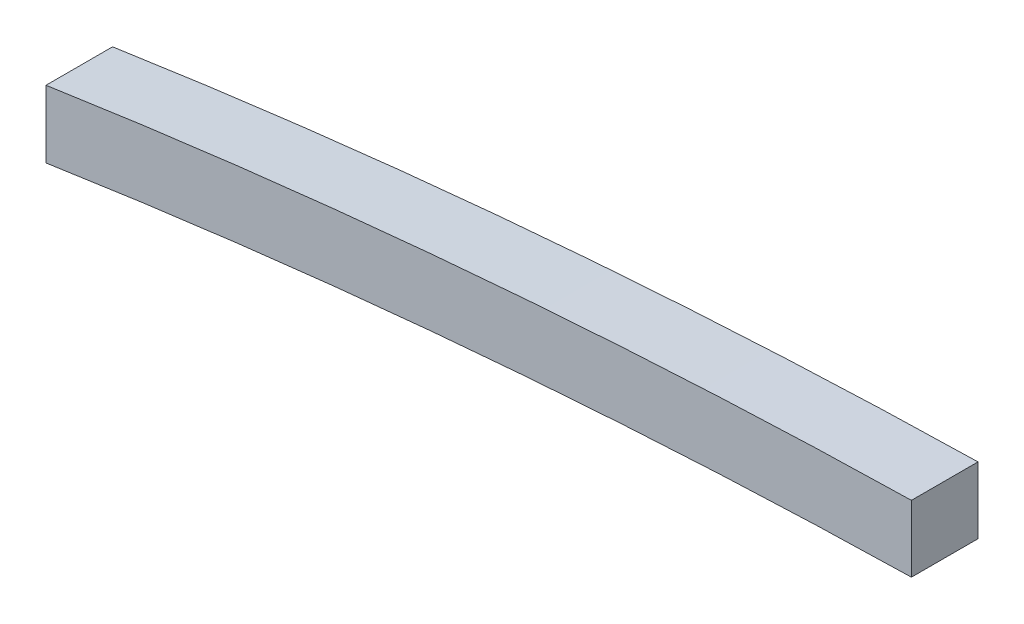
from build123d import *

# Parameters (mm, degrees)
LINEAR_AUSTRAGEN1_DEPTH = 50


with BuildPart() as part:
    # Skizze1 → Linear austragen1 (new body)
    with BuildSketch(Plane.XY):
        with BuildLine():
            Line((0, 50.566412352), (0, 0))
            ThreePointArc((0, 0), (324.092728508, 38.397291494), (650, 55.569916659))
            Line((650, 55.569916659), (650, 105.579820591))
            ThreePointArc((650, 105.579820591), (324.110790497, 88.579394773), (0, 50.566412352))
        make_face()
    extrude(amount=-LINEAR_AUSTRAGEN1_DEPTH)


solid = part.part
